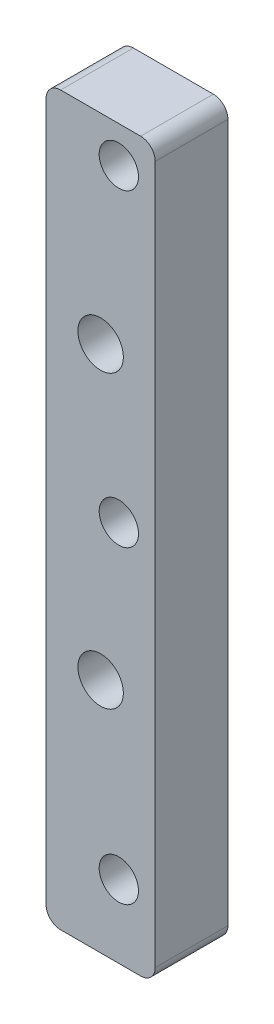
ISO-10303-21;
HEADER;
FILE_DESCRIPTION(('STEP AP214'),'2;1');
FILE_NAME('part.step','',(''),(''),'','','');
FILE_SCHEMA(('AUTOMOTIVE_DESIGN { 1 0 10303 214 1 1 1 1 }'));
ENDSEC;
DATA;
#1=APPLICATION_CONTEXT('core data for automotive mechanical design processes');
#2=APPLICATION_PROTOCOL_DEFINITION('international standard','automotive_design',2000,#1);
#3=PRODUCT_CONTEXT('',#1,'mechanical');
#4=PRODUCT('Part','Part','',(#3));
#5=PRODUCT_RELATED_PRODUCT_CATEGORY('part','',(#4));
#6=PRODUCT_DEFINITION_FORMATION('','',#4);
#7=PRODUCT_DEFINITION_CONTEXT('part definition',#1,'design');
#8=PRODUCT_DEFINITION('design','',#6,#7);
#9=PRODUCT_DEFINITION_SHAPE('','',#8);
#10=(LENGTH_UNIT() NAMED_UNIT(*) SI_UNIT(.MILLI.,.METRE.));
#11=(NAMED_UNIT(*) PLANE_ANGLE_UNIT() SI_UNIT($,.RADIAN.));
#12=(NAMED_UNIT(*) SI_UNIT($,.STERADIAN.) SOLID_ANGLE_UNIT());
#13=UNCERTAINTY_MEASURE_WITH_UNIT(LENGTH_MEASURE(1.E-05),#10,'distance_accuracy_value','');
#14=(GEOMETRIC_REPRESENTATION_CONTEXT(3) GLOBAL_UNCERTAINTY_ASSIGNED_CONTEXT((#13)) GLOBAL_UNIT_ASSIGNED_CONTEXT((#10,
#11,#12)) REPRESENTATION_CONTEXT('',''));
#15=CARTESIAN_POINT('',(0.,0.,0.));
#16=DIRECTION('',(0.,0.,1.));
#17=DIRECTION('',(1.,0.,0.));
#18=AXIS2_PLACEMENT_3D('',#15,#16,#17);
#19=CARTESIAN_POINT('',(-7.68933965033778,54.7924130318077,12.7));
#20=DIRECTION('',(1.,0.,0.));
#21=DIRECTION('',(0.,1.,0.));
#22=AXIS2_PLACEMENT_3D('',#19,#20,#21);
#23=PLANE('',#22);
#24=DIRECTION('',(0.,-1.,0.));
#25=VECTOR('',#24,1.);
#26=CARTESIAN_POINT('',(-7.68933965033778,54.7924130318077,0.));
#27=LINE('',#26,#25);
#28=CARTESIAN_POINT('',(-7.68933965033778,52.2524130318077,0.));
#29=VERTEX_POINT('',#28);
#30=CARTESIAN_POINT('',(-7.68933965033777,-69.6675869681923,0.));
#31=VERTEX_POINT('',#30);
#32=EDGE_CURVE('E128',#29,#31,#27,.T.);
#33=ORIENTED_EDGE('',*,*,#32,.T.);
#34=DIRECTION('',(0.,0.,-1.));
#35=VECTOR('',#34,1.);
#36=CARTESIAN_POINT('',(-7.68933965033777,-69.6675869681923,12.7));
#37=LINE('',#36,#35);
#38=CARTESIAN_POINT('',(-7.68933965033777,-69.6675869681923,12.7));
#39=VERTEX_POINT('',#38);
#40=EDGE_CURVE('E150',#31,#39,#37,.F.);
#41=ORIENTED_EDGE('',*,*,#40,.T.);
#42=DIRECTION('',(0.,-1.,0.));
#43=VECTOR('',#42,1.);
#44=CARTESIAN_POINT('',(-7.68933965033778,54.7924130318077,12.7));
#45=LINE('',#44,#43);
#46=CARTESIAN_POINT('',(-7.68933965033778,52.2524130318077,12.7));
#47=VERTEX_POINT('',#46);
#48=EDGE_CURVE('E126',#47,#39,#45,.T.);
#49=ORIENTED_EDGE('',*,*,#48,.F.);
#50=DIRECTION('',(0.,0.,-1.));
#51=VECTOR('',#50,1.);
#52=CARTESIAN_POINT('',(-7.68933965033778,52.2524130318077,12.7));
#53=LINE('',#52,#51);
#54=EDGE_CURVE('E147',#47,#29,#53,.T.);
#55=ORIENTED_EDGE('',*,*,#54,.T.);
#56=EDGE_LOOP('',(#33,#41,#49,#55));
#57=FACE_BOUND('',#56,.T.);
#58=ADVANCED_FACE('F31',(#57),#23,.F.);
#59=CARTESIAN_POINT('',(-7.68933965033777,-72.2075869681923,12.7));
#60=DIRECTION('',(0.,1.,0.));
#61=DIRECTION('',(0.,0.,1.));
#62=AXIS2_PLACEMENT_3D('',#59,#60,#61);
#63=PLANE('',#62);
#64=DIRECTION('',(1.,0.,0.));
#65=VECTOR('',#64,1.);
#66=CARTESIAN_POINT('',(-7.68933965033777,-72.2075869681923,0.));
#67=LINE('',#66,#65);
#68=CARTESIAN_POINT('',(-5.14933965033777,-72.2075869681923,0.));
#69=VERTEX_POINT('',#68);
#70=CARTESIAN_POINT('',(8.82066034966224,-72.2075869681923,0.));
#71=VERTEX_POINT('',#70);
#72=EDGE_CURVE('E124',#69,#71,#67,.T.);
#73=ORIENTED_EDGE('',*,*,#72,.T.);
#74=DIRECTION('',(0.,0.,-1.));
#75=VECTOR('',#74,1.);
#76=CARTESIAN_POINT('',(8.82066034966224,-72.2075869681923,12.7));
#77=LINE('',#76,#75);
#78=CARTESIAN_POINT('',(8.82066034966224,-72.2075869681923,12.7));
#79=VERTEX_POINT('',#78);
#80=EDGE_CURVE('E102',#71,#79,#77,.F.);
#81=ORIENTED_EDGE('',*,*,#80,.T.);
#82=DIRECTION('',(1.,0.,0.));
#83=VECTOR('',#82,1.);
#84=CARTESIAN_POINT('',(-7.68933965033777,-72.2075869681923,12.7));
#85=LINE('',#84,#83);
#86=CARTESIAN_POINT('',(-5.14933965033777,-72.2075869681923,12.7));
#87=VERTEX_POINT('',#86);
#88=EDGE_CURVE('E164',#87,#79,#85,.T.);
#89=ORIENTED_EDGE('',*,*,#88,.F.);
#90=DIRECTION('',(0.,0.,-1.));
#91=VECTOR('',#90,1.);
#92=CARTESIAN_POINT('',(-5.14933965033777,-72.2075869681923,12.7));
#93=LINE('',#92,#91);
#94=EDGE_CURVE('E107',#87,#69,#93,.T.);
#95=ORIENTED_EDGE('',*,*,#94,.T.);
#96=EDGE_LOOP('',(#73,#81,#89,#95));
#97=FACE_BOUND('',#96,.T.);
#98=ADVANCED_FACE('F169',(#97),#63,.F.);
#99=CARTESIAN_POINT('',(11.3606603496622,54.7924130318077,12.7));
#100=DIRECTION('',(-1.,0.,0.));
#101=DIRECTION('',(0.,-1.,0.));
#102=AXIS2_PLACEMENT_3D('',#99,#100,#101);
#103=PLANE('',#102);
#104=DIRECTION('',(0.,1.,0.));
#105=VECTOR('',#104,1.);
#106=CARTESIAN_POINT('',(11.3606603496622,54.7924130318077,12.7));
#107=LINE('',#106,#105);
#108=CARTESIAN_POINT('',(11.3606603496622,-69.6675869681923,12.7));
#109=VERTEX_POINT('',#108);
#110=CARTESIAN_POINT('',(11.3606603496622,52.2524130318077,12.7));
#111=VERTEX_POINT('',#110);
#112=EDGE_CURVE('E116',#109,#111,#107,.T.);
#113=ORIENTED_EDGE('',*,*,#112,.F.);
#114=DIRECTION('',(0.,0.,-1.));
#115=VECTOR('',#114,1.);
#116=CARTESIAN_POINT('',(11.3606603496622,-69.6675869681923,12.7));
#117=LINE('',#116,#115);
#118=CARTESIAN_POINT('',(11.3606603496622,-69.6675869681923,0.));
#119=VERTEX_POINT('',#118);
#120=EDGE_CURVE('E101',#109,#119,#117,.T.);
#121=ORIENTED_EDGE('',*,*,#120,.T.);
#122=DIRECTION('',(0.,1.,0.));
#123=VECTOR('',#122,1.);
#124=CARTESIAN_POINT('',(11.3606603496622,54.7924130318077,0.));
#125=LINE('',#124,#123);
#126=CARTESIAN_POINT('',(11.3606603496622,52.2524130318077,0.));
#127=VERTEX_POINT('',#126);
#128=EDGE_CURVE('E114',#119,#127,#125,.T.);
#129=ORIENTED_EDGE('',*,*,#128,.T.);
#130=DIRECTION('',(0.,0.,-1.));
#131=VECTOR('',#130,1.);
#132=CARTESIAN_POINT('',(11.3606603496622,52.2524130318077,12.7));
#133=LINE('',#132,#131);
#134=EDGE_CURVE('E118',#127,#111,#133,.F.);
#135=ORIENTED_EDGE('',*,*,#134,.T.);
#136=EDGE_LOOP('',(#113,#121,#129,#135));
#137=FACE_BOUND('',#136,.T.);
#138=ADVANCED_FACE('F113',(#137),#103,.F.);
#139=CARTESIAN_POINT('',(-7.68933965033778,54.7924130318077,12.7));
#140=DIRECTION('',(0.,-1.,0.));
#141=DIRECTION('',(0.,0.,-1.));
#142=AXIS2_PLACEMENT_3D('',#139,#140,#141);
#143=PLANE('',#142);
#144=DIRECTION('',(-1.,0.,0.));
#145=VECTOR('',#144,1.);
#146=CARTESIAN_POINT('',(-7.68933965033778,54.7924130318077,12.7));
#147=LINE('',#146,#145);
#148=CARTESIAN_POINT('',(8.82066034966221,54.7924130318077,12.7));
#149=VERTEX_POINT('',#148);
#150=CARTESIAN_POINT('',(-5.14933965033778,54.7924130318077,12.7));
#151=VERTEX_POINT('',#150);
#152=EDGE_CURVE('E132',#149,#151,#147,.T.);
#153=ORIENTED_EDGE('',*,*,#152,.F.);
#154=DIRECTION('',(0.,0.,-1.));
#155=VECTOR('',#154,1.);
#156=CARTESIAN_POINT('',(8.82066034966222,54.7924130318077,12.7));
#157=LINE('',#156,#155);
#158=CARTESIAN_POINT('',(8.82066034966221,54.7924130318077,0.));
#159=VERTEX_POINT('',#158);
#160=EDGE_CURVE('E11',#149,#159,#157,.T.);
#161=ORIENTED_EDGE('',*,*,#160,.T.);
#162=DIRECTION('',(-1.,0.,0.));
#163=VECTOR('',#162,1.);
#164=CARTESIAN_POINT('',(-7.68933965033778,54.7924130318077,0.));
#165=LINE('',#164,#163);
#166=CARTESIAN_POINT('',(-5.14933965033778,54.7924130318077,0.));
#167=VERTEX_POINT('',#166);
#168=EDGE_CURVE('E123',#159,#167,#165,.T.);
#169=ORIENTED_EDGE('',*,*,#168,.T.);
#170=DIRECTION('',(0.,0.,-1.));
#171=VECTOR('',#170,1.);
#172=CARTESIAN_POINT('',(-5.14933965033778,54.7924130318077,12.7));
#173=LINE('',#172,#171);
#174=EDGE_CURVE('E39',#167,#151,#173,.F.);
#175=ORIENTED_EDGE('',*,*,#174,.T.);
#176=EDGE_LOOP('',(#153,#161,#169,#175));
#177=FACE_BOUND('',#176,.T.);
#178=ADVANCED_FACE('F216',(#177),#143,.F.);
#179=CARTESIAN_POINT('',(-7.68933965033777,-72.2075869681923,12.7));
#180=DIRECTION('',(0.,0.,1.));
#181=DIRECTION('',(1.,0.,0.));
#182=AXIS2_PLACEMENT_3D('',#179,#180,#181);
#183=PLANE('',#182);
#184=CARTESIAN_POINT('',(1.83566034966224,-30.9325869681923,12.7));
#185=DIRECTION('',(0.,0.,1.));
#186=DIRECTION('',(1.,0.,0.));
#187=AXIS2_PLACEMENT_3D('',#184,#185,#186);
#188=CIRCLE('',#187,3.96875);
#189=CARTESIAN_POINT('',(5.80441034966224,-30.9325869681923,12.7));
#190=VERTEX_POINT('',#189);
#191=EDGE_CURVE('E199',#190,#190,#188,.T.);
#192=ORIENTED_EDGE('',*,*,#191,.F.);
#193=EDGE_LOOP('',(#192));
#194=FACE_BOUND('',#193,.T.);
#195=CARTESIAN_POINT('',(1.83566034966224,19.8674130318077,12.7));
#196=DIRECTION('',(0.,0.,1.));
#197=DIRECTION('',(1.,0.,0.));
#198=AXIS2_PLACEMENT_3D('',#195,#196,#197);
#199=CIRCLE('',#198,3.96875);
#200=CARTESIAN_POINT('',(5.80441034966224,19.8674130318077,12.7));
#201=VERTEX_POINT('',#200);
#202=EDGE_CURVE('E193',#201,#201,#199,.T.);
#203=ORIENTED_EDGE('',*,*,#202,.F.);
#204=EDGE_LOOP('',(#203));
#205=FACE_BOUND('',#204,.T.);
#206=CARTESIAN_POINT('',(5.01066034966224,-5.53258696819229,12.7));
#207=DIRECTION('',(0.,0.,1.));
#208=DIRECTION('',(1.,0.,0.));
#209=AXIS2_PLACEMENT_3D('',#206,#207,#208);
#210=CIRCLE('',#209,3.429);
#211=CARTESIAN_POINT('',(8.43966034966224,-5.53258696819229,12.7));
#212=VERTEX_POINT('',#211);
#213=EDGE_CURVE('E187',#212,#212,#210,.T.);
#214=ORIENTED_EDGE('',*,*,#213,.F.);
#215=EDGE_LOOP('',(#214));
#216=FACE_BOUND('',#215,.T.);
#217=CARTESIAN_POINT('',(5.01066034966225,-59.5075869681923,12.7));
#218=DIRECTION('',(0.,0.,1.));
#219=DIRECTION('',(1.,0.,0.));
#220=AXIS2_PLACEMENT_3D('',#217,#218,#219);
#221=CIRCLE('',#220,3.429);
#222=CARTESIAN_POINT('',(8.43966034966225,-59.5075869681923,12.7));
#223=VERTEX_POINT('',#222);
#224=EDGE_CURVE('E181',#223,#223,#221,.T.);
#225=ORIENTED_EDGE('',*,*,#224,.F.);
#226=EDGE_LOOP('',(#225));
#227=FACE_BOUND('',#226,.T.);
#228=CARTESIAN_POINT('',(5.01066034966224,48.4424130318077,12.7));
#229=DIRECTION('',(0.,0.,1.));
#230=DIRECTION('',(1.,0.,0.));
#231=AXIS2_PLACEMENT_3D('',#228,#229,#230);
#232=CIRCLE('',#231,3.429);
#233=CARTESIAN_POINT('',(8.43966034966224,48.4424130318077,12.7));
#234=VERTEX_POINT('',#233);
#235=EDGE_CURVE('E172',#234,#234,#232,.T.);
#236=ORIENTED_EDGE('',*,*,#235,.F.);
#237=EDGE_LOOP('',(#236));
#238=FACE_BOUND('',#237,.T.);
#239=ORIENTED_EDGE('',*,*,#88,.T.);
#240=CARTESIAN_POINT('',(8.82066034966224,-69.6675869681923,12.7));
#241=DIRECTION('',(0.,0.,1.));
#242=DIRECTION('',(1.,0.,0.));
#243=AXIS2_PLACEMENT_3D('',#240,#241,#242);
#244=CIRCLE('',#243,2.54);
#245=EDGE_CURVE('E145',#79,#109,#244,.T.);
#246=ORIENTED_EDGE('',*,*,#245,.T.);
#247=ORIENTED_EDGE('',*,*,#112,.T.);
#248=CARTESIAN_POINT('',(8.82066034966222,52.2524130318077,12.7));
#249=DIRECTION('',(0.,0.,1.));
#250=DIRECTION('',(1.,0.,0.));
#251=AXIS2_PLACEMENT_3D('',#248,#249,#250);
#252=CIRCLE('',#251,2.54);
#253=EDGE_CURVE('E52',#111,#149,#252,.T.);
#254=ORIENTED_EDGE('',*,*,#253,.T.);
#255=ORIENTED_EDGE('',*,*,#152,.T.);
#256=CARTESIAN_POINT('',(-5.14933965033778,52.2524130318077,12.7));
#257=DIRECTION('',(0.,0.,1.));
#258=DIRECTION('',(1.,0.,0.));
#259=AXIS2_PLACEMENT_3D('',#256,#257,#258);
#260=CIRCLE('',#259,2.54);
#261=EDGE_CURVE('E140',#151,#47,#260,.T.);
#262=ORIENTED_EDGE('',*,*,#261,.T.);
#263=ORIENTED_EDGE('',*,*,#48,.T.);
#264=CARTESIAN_POINT('',(-5.14933965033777,-69.6675869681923,12.7));
#265=DIRECTION('',(0.,0.,1.));
#266=DIRECTION('',(1.,0.,0.));
#267=AXIS2_PLACEMENT_3D('',#264,#265,#266);
#268=CIRCLE('',#267,2.54);
#269=EDGE_CURVE('E143',#39,#87,#268,.T.);
#270=ORIENTED_EDGE('',*,*,#269,.T.);
#271=EDGE_LOOP('',(#239,#246,#247,#254,#255,#262,#263,#270));
#272=FACE_BOUND('',#271,.T.);
#273=ADVANCED_FACE('F161',(#194,#205,#216,#227,#238,#272),#183,.T.);
#274=CARTESIAN_POINT('',(-7.68933965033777,-72.2075869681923,0.));
#275=DIRECTION('',(0.,0.,1.));
#276=DIRECTION('',(1.,0.,0.));
#277=AXIS2_PLACEMENT_3D('',#274,#275,#276);
#278=PLANE('',#277);
#279=CARTESIAN_POINT('',(1.83566034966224,-30.9325869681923,0.));
#280=DIRECTION('',(0.,0.,1.));
#281=DIRECTION('',(1.,0.,0.));
#282=AXIS2_PLACEMENT_3D('',#279,#280,#281);
#283=CIRCLE('',#282,3.96875);
#284=CARTESIAN_POINT('',(5.80441034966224,-30.9325869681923,0.));
#285=VERTEX_POINT('',#284);
#286=EDGE_CURVE('E196',#285,#285,#283,.T.);
#287=ORIENTED_EDGE('',*,*,#286,.T.);
#288=EDGE_LOOP('',(#287));
#289=FACE_BOUND('',#288,.T.);
#290=CARTESIAN_POINT('',(1.83566034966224,19.8674130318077,0.));
#291=DIRECTION('',(0.,0.,1.));
#292=DIRECTION('',(1.,0.,0.));
#293=AXIS2_PLACEMENT_3D('',#290,#291,#292);
#294=CIRCLE('',#293,3.96875);
#295=CARTESIAN_POINT('',(5.80441034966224,19.8674130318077,0.));
#296=VERTEX_POINT('',#295);
#297=EDGE_CURVE('E190',#296,#296,#294,.T.);
#298=ORIENTED_EDGE('',*,*,#297,.T.);
#299=EDGE_LOOP('',(#298));
#300=FACE_BOUND('',#299,.T.);
#301=CARTESIAN_POINT('',(5.01066034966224,-5.53258696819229,0.));
#302=DIRECTION('',(0.,0.,1.));
#303=DIRECTION('',(1.,0.,0.));
#304=AXIS2_PLACEMENT_3D('',#301,#302,#303);
#305=CIRCLE('',#304,3.429);
#306=CARTESIAN_POINT('',(8.43966034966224,-5.53258696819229,0.));
#307=VERTEX_POINT('',#306);
#308=EDGE_CURVE('E184',#307,#307,#305,.T.);
#309=ORIENTED_EDGE('',*,*,#308,.T.);
#310=EDGE_LOOP('',(#309));
#311=FACE_BOUND('',#310,.T.);
#312=CARTESIAN_POINT('',(5.01066034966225,-59.5075869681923,0.));
#313=DIRECTION('',(0.,0.,1.));
#314=DIRECTION('',(1.,0.,0.));
#315=AXIS2_PLACEMENT_3D('',#312,#313,#314);
#316=CIRCLE('',#315,3.429);
#317=CARTESIAN_POINT('',(8.43966034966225,-59.5075869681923,0.));
#318=VERTEX_POINT('',#317);
#319=EDGE_CURVE('E179',#318,#318,#316,.T.);
#320=ORIENTED_EDGE('',*,*,#319,.T.);
#321=EDGE_LOOP('',(#320));
#322=FACE_BOUND('',#321,.T.);
#323=CARTESIAN_POINT('',(5.01066034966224,48.4424130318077,0.));
#324=DIRECTION('',(0.,0.,1.));
#325=DIRECTION('',(1.,0.,0.));
#326=AXIS2_PLACEMENT_3D('',#323,#324,#325);
#327=CIRCLE('',#326,3.429);
#328=CARTESIAN_POINT('',(8.43966034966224,48.4424130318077,0.));
#329=VERTEX_POINT('',#328);
#330=EDGE_CURVE('E170',#329,#329,#327,.T.);
#331=ORIENTED_EDGE('',*,*,#330,.T.);
#332=EDGE_LOOP('',(#331));
#333=FACE_BOUND('',#332,.T.);
#334=ORIENTED_EDGE('',*,*,#128,.F.);
#335=CARTESIAN_POINT('',(8.82066034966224,-69.6675869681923,0.));
#336=DIRECTION('',(0.,0.,1.));
#337=DIRECTION('',(1.,0.,0.));
#338=AXIS2_PLACEMENT_3D('',#335,#336,#337);
#339=CIRCLE('',#338,2.54);
#340=EDGE_CURVE('E97',#119,#71,#339,.F.);
#341=ORIENTED_EDGE('',*,*,#340,.T.);
#342=ORIENTED_EDGE('',*,*,#72,.F.);
#343=CARTESIAN_POINT('',(-5.14933965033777,-69.6675869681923,0.));
#344=DIRECTION('',(0.,0.,1.));
#345=DIRECTION('',(1.,0.,0.));
#346=AXIS2_PLACEMENT_3D('',#343,#344,#345);
#347=CIRCLE('',#346,2.54);
#348=EDGE_CURVE('E108',#69,#31,#347,.F.);
#349=ORIENTED_EDGE('',*,*,#348,.T.);
#350=ORIENTED_EDGE('',*,*,#32,.F.);
#351=CARTESIAN_POINT('',(-5.14933965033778,52.2524130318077,0.));
#352=DIRECTION('',(0.,0.,1.));
#353=DIRECTION('',(1.,0.,0.));
#354=AXIS2_PLACEMENT_3D('',#351,#352,#353);
#355=CIRCLE('',#354,2.54);
#356=EDGE_CURVE('E117',#29,#167,#355,.F.);
#357=ORIENTED_EDGE('',*,*,#356,.T.);
#358=ORIENTED_EDGE('',*,*,#168,.F.);
#359=CARTESIAN_POINT('',(8.82066034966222,52.2524130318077,0.));
#360=DIRECTION('',(0.,0.,1.));
#361=DIRECTION('',(1.,0.,0.));
#362=AXIS2_PLACEMENT_3D('',#359,#360,#361);
#363=CIRCLE('',#362,2.54);
#364=EDGE_CURVE('E122',#159,#127,#363,.F.);
#365=ORIENTED_EDGE('',*,*,#364,.T.);
#366=EDGE_LOOP('',(#334,#341,#342,#349,#350,#357,#358,#365));
#367=FACE_BOUND('',#366,.T.);
#368=ADVANCED_FACE('F120',(#289,#300,#311,#322,#333,#367),#278,.F.);
#369=CARTESIAN_POINT('',(5.01066034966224,48.4424130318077,0.));
#370=DIRECTION('',(0.,0.,1.));
#371=DIRECTION('',(1.,0.,0.));
#372=AXIS2_PLACEMENT_3D('',#369,#370,#371);
#373=CYLINDRICAL_SURFACE('',#372,3.429);
#374=ORIENTED_EDGE('',*,*,#330,.F.);
#375=EDGE_LOOP('',(#374));
#376=FACE_BOUND('',#375,.T.);
#377=ORIENTED_EDGE('',*,*,#235,.T.);
#378=EDGE_LOOP('',(#377));
#379=FACE_BOUND('',#378,.T.);
#380=ADVANCED_FACE('F226',(#376,#379),#373,.F.);
#381=CARTESIAN_POINT('',(5.01066034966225,-59.5075869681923,0.));
#382=DIRECTION('',(0.,0.,1.));
#383=DIRECTION('',(1.,0.,0.));
#384=AXIS2_PLACEMENT_3D('',#381,#382,#383);
#385=CYLINDRICAL_SURFACE('',#384,3.429);
#386=ORIENTED_EDGE('',*,*,#319,.F.);
#387=EDGE_LOOP('',(#386));
#388=FACE_BOUND('',#387,.T.);
#389=ORIENTED_EDGE('',*,*,#224,.T.);
#390=EDGE_LOOP('',(#389));
#391=FACE_BOUND('',#390,.T.);
#392=ADVANCED_FACE('F228',(#388,#391),#385,.F.);
#393=CARTESIAN_POINT('',(5.01066034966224,-5.53258696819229,0.));
#394=DIRECTION('',(0.,0.,1.));
#395=DIRECTION('',(1.,0.,0.));
#396=AXIS2_PLACEMENT_3D('',#393,#394,#395);
#397=CYLINDRICAL_SURFACE('',#396,3.429);
#398=ORIENTED_EDGE('',*,*,#308,.F.);
#399=EDGE_LOOP('',(#398));
#400=FACE_BOUND('',#399,.T.);
#401=ORIENTED_EDGE('',*,*,#213,.T.);
#402=EDGE_LOOP('',(#401));
#403=FACE_BOUND('',#402,.T.);
#404=ADVANCED_FACE('F235',(#400,#403),#397,.F.);
#405=CARTESIAN_POINT('',(1.83566034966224,19.8674130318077,0.));
#406=DIRECTION('',(0.,0.,1.));
#407=DIRECTION('',(1.,0.,0.));
#408=AXIS2_PLACEMENT_3D('',#405,#406,#407);
#409=CYLINDRICAL_SURFACE('',#408,3.96875);
#410=ORIENTED_EDGE('',*,*,#297,.F.);
#411=EDGE_LOOP('',(#410));
#412=FACE_BOUND('',#411,.T.);
#413=ORIENTED_EDGE('',*,*,#202,.T.);
#414=EDGE_LOOP('',(#413));
#415=FACE_BOUND('',#414,.T.);
#416=ADVANCED_FACE('F210',(#412,#415),#409,.F.);
#417=CARTESIAN_POINT('',(1.83566034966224,-30.9325869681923,0.));
#418=DIRECTION('',(0.,0.,1.));
#419=DIRECTION('',(1.,0.,0.));
#420=AXIS2_PLACEMENT_3D('',#417,#418,#419);
#421=CYLINDRICAL_SURFACE('',#420,3.96875);
#422=ORIENTED_EDGE('',*,*,#286,.F.);
#423=EDGE_LOOP('',(#422));
#424=FACE_BOUND('',#423,.T.);
#425=ORIENTED_EDGE('',*,*,#191,.T.);
#426=EDGE_LOOP('',(#425));
#427=FACE_BOUND('',#426,.T.);
#428=ADVANCED_FACE('F207',(#424,#427),#421,.F.);
#429=CARTESIAN_POINT('',(8.82066034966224,-69.6675869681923,12.7));
#430=DIRECTION('',(0.,0.,-1.));
#431=DIRECTION('',(-1.,0.,0.));
#432=AXIS2_PLACEMENT_3D('',#429,#430,#431);
#433=CYLINDRICAL_SURFACE('',#432,2.54);
#434=ORIENTED_EDGE('',*,*,#245,.F.);
#435=ORIENTED_EDGE('',*,*,#80,.F.);
#436=ORIENTED_EDGE('',*,*,#340,.F.);
#437=ORIENTED_EDGE('',*,*,#120,.F.);
#438=EDGE_LOOP('',(#434,#435,#436,#437));
#439=FACE_BOUND('',#438,.T.);
#440=ADVANCED_FACE('F100',(#439),#433,.T.);
#441=CARTESIAN_POINT('',(-5.14933965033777,-69.6675869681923,12.7));
#442=DIRECTION('',(0.,0.,-1.));
#443=DIRECTION('',(-1.,0.,0.));
#444=AXIS2_PLACEMENT_3D('',#441,#442,#443);
#445=CYLINDRICAL_SURFACE('',#444,2.54);
#446=ORIENTED_EDGE('',*,*,#269,.F.);
#447=ORIENTED_EDGE('',*,*,#40,.F.);
#448=ORIENTED_EDGE('',*,*,#348,.F.);
#449=ORIENTED_EDGE('',*,*,#94,.F.);
#450=EDGE_LOOP('',(#446,#447,#448,#449));
#451=FACE_BOUND('',#450,.T.);
#452=ADVANCED_FACE('F167',(#451),#445,.T.);
#453=CARTESIAN_POINT('',(8.82066034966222,52.2524130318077,12.7));
#454=DIRECTION('',(0.,0.,-1.));
#455=DIRECTION('',(-1.,0.,0.));
#456=AXIS2_PLACEMENT_3D('',#453,#454,#455);
#457=CYLINDRICAL_SURFACE('',#456,2.54);
#458=ORIENTED_EDGE('',*,*,#253,.F.);
#459=ORIENTED_EDGE('',*,*,#134,.F.);
#460=ORIENTED_EDGE('',*,*,#364,.F.);
#461=ORIENTED_EDGE('',*,*,#160,.F.);
#462=EDGE_LOOP('',(#458,#459,#460,#461));
#463=FACE_BOUND('',#462,.T.);
#464=ADVANCED_FACE('F251',(#463),#457,.T.);
#465=CARTESIAN_POINT('',(-5.14933965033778,52.2524130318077,12.7));
#466=DIRECTION('',(0.,0.,-1.));
#467=DIRECTION('',(-1.,0.,0.));
#468=AXIS2_PLACEMENT_3D('',#465,#466,#467);
#469=CYLINDRICAL_SURFACE('',#468,2.54);
#470=ORIENTED_EDGE('',*,*,#261,.F.);
#471=ORIENTED_EDGE('',*,*,#174,.F.);
#472=ORIENTED_EDGE('',*,*,#356,.F.);
#473=ORIENTED_EDGE('',*,*,#54,.F.);
#474=EDGE_LOOP('',(#470,#471,#472,#473));
#475=FACE_BOUND('',#474,.T.);
#476=ADVANCED_FACE('F33',(#475),#469,.T.);
#477=CLOSED_SHELL('',(#58,#98,#138,#178,#273,#368,#380,#392,#404,#416,#428,#440,#452,#464,#476));
#478=MANIFOLD_SOLID_BREP('B2',#477);
#479=ADVANCED_BREP_SHAPE_REPRESENTATION('',(#18,#478),#14);
#480=SHAPE_DEFINITION_REPRESENTATION(#9,#479);
ENDSEC;
END-ISO-10303-21;
